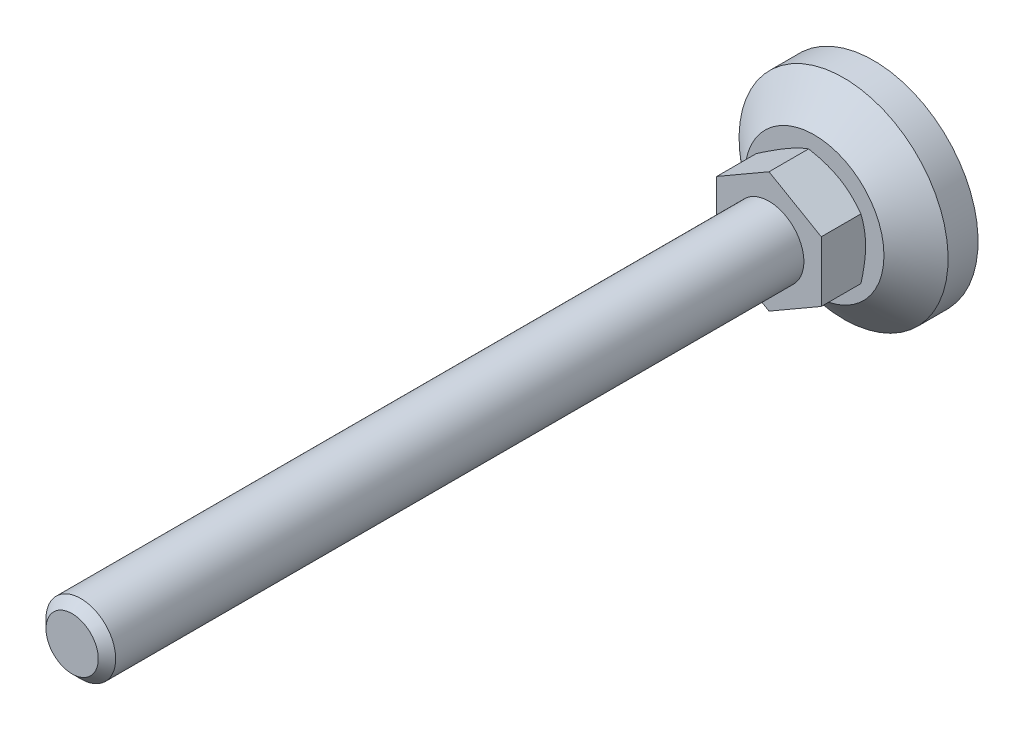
ISO-10303-21;
HEADER;
FILE_DESCRIPTION(('STEP AP214'),'2;1');
FILE_NAME('part.step','',(''),(''),'','','');
FILE_SCHEMA(('AUTOMOTIVE_DESIGN { 1 0 10303 214 1 1 1 1 }'));
ENDSEC;
DATA;
#1=APPLICATION_CONTEXT('core data for automotive mechanical design processes');
#2=APPLICATION_PROTOCOL_DEFINITION('international standard','automotive_design',2000,#1);
#3=PRODUCT_CONTEXT('',#1,'mechanical');
#4=PRODUCT('Part','Part','',(#3));
#5=PRODUCT_RELATED_PRODUCT_CATEGORY('part','',(#4));
#6=PRODUCT_DEFINITION_FORMATION('','',#4);
#7=PRODUCT_DEFINITION_CONTEXT('part definition',#1,'design');
#8=PRODUCT_DEFINITION('design','',#6,#7);
#9=PRODUCT_DEFINITION_SHAPE('','',#8);
#10=(LENGTH_UNIT() NAMED_UNIT(*) SI_UNIT(.MILLI.,.METRE.));
#11=(NAMED_UNIT(*) PLANE_ANGLE_UNIT() SI_UNIT($,.RADIAN.));
#12=(NAMED_UNIT(*) SI_UNIT($,.STERADIAN.) SOLID_ANGLE_UNIT());
#13=UNCERTAINTY_MEASURE_WITH_UNIT(LENGTH_MEASURE(1.E-05),#10,'distance_accuracy_value','');
#14=(GEOMETRIC_REPRESENTATION_CONTEXT(3) GLOBAL_UNCERTAINTY_ASSIGNED_CONTEXT((#13)) GLOBAL_UNIT_ASSIGNED_CONTEXT((#10,
#11,#12)) REPRESENTATION_CONTEXT('',''));
#15=CARTESIAN_POINT('',(0.,0.,0.));
#16=DIRECTION('',(0.,0.,1.));
#17=DIRECTION('',(1.,0.,0.));
#18=AXIS2_PLACEMENT_3D('',#15,#16,#17);
#19=CARTESIAN_POINT('',(0.,0.,30.));
#20=DIRECTION('',(0.,0.,1.));
#21=DIRECTION('',(0.5,-0.86602540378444,0.));
#22=AXIS2_PLACEMENT_3D('',#19,#20,#21);
#23=PLANE('',#22);
#24=DIRECTION('',(0.,1.,0.));
#25=VECTOR('',#24,1.);
#26=CARTESIAN_POINT('',(15.,-8.66025403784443,30.));
#27=LINE('',#26,#25);
#28=CARTESIAN_POINT('',(15.,-8.66025403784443,30.));
#29=VERTEX_POINT('',#28);
#30=CARTESIAN_POINT('',(15.,8.66025403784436,30.));
#31=VERTEX_POINT('',#30);
#32=EDGE_CURVE('E197',#29,#31,#27,.T.);
#33=ORIENTED_EDGE('',*,*,#32,.T.);
#34=DIRECTION('',(-0.866025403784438,0.5,0.));
#35=VECTOR('',#34,1.);
#36=CARTESIAN_POINT('',(15.,8.66025403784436,30.));
#37=LINE('',#36,#35);
#38=CARTESIAN_POINT('',(0.,17.3205080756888,30.));
#39=VERTEX_POINT('',#38);
#40=EDGE_CURVE('E320',#31,#39,#37,.T.);
#41=ORIENTED_EDGE('',*,*,#40,.T.);
#42=DIRECTION('',(-0.86602540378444,-0.5,0.));
#43=VECTOR('',#42,1.);
#44=CARTESIAN_POINT('',(0.,17.3205080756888,30.));
#45=LINE('',#44,#43);
#46=CARTESIAN_POINT('',(-15.,8.66025403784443,30.));
#47=VERTEX_POINT('',#46);
#48=EDGE_CURVE('E319',#39,#47,#45,.T.);
#49=ORIENTED_EDGE('',*,*,#48,.T.);
#50=DIRECTION('',(0.,-1.,0.));
#51=VECTOR('',#50,1.);
#52=CARTESIAN_POINT('',(-15.,8.66025403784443,30.));
#53=LINE('',#52,#51);
#54=CARTESIAN_POINT('',(-15.,-8.66025403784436,30.));
#55=VERTEX_POINT('',#54);
#56=EDGE_CURVE('E324',#47,#55,#53,.T.);
#57=ORIENTED_EDGE('',*,*,#56,.T.);
#58=DIRECTION('',(0.866025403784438,-0.5,0.));
#59=VECTOR('',#58,1.);
#60=CARTESIAN_POINT('',(-15.,-8.66025403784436,30.));
#61=LINE('',#60,#59);
#62=CARTESIAN_POINT('',(0.,-17.3205080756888,30.));
#63=VERTEX_POINT('',#62);
#64=EDGE_CURVE('E326',#55,#63,#61,.T.);
#65=ORIENTED_EDGE('',*,*,#64,.T.);
#66=DIRECTION('',(0.86602540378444,0.5,0.));
#67=VECTOR('',#66,1.);
#68=CARTESIAN_POINT('',(0.,-17.3205080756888,30.));
#69=LINE('',#68,#67);
#70=EDGE_CURVE('E37',#63,#29,#69,.T.);
#71=ORIENTED_EDGE('',*,*,#70,.T.);
#72=EDGE_LOOP('',(#33,#41,#49,#57,#65,#71));
#73=FACE_BOUND('',#72,.T.);
#74=CARTESIAN_POINT('',(0.,0.,30.));
#75=DIRECTION('',(0.,0.,1.));
#76=DIRECTION('',(0.5,-0.86602540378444,0.));
#77=AXIS2_PLACEMENT_3D('',#74,#75,#76);
#78=CIRCLE('',#77,10.);
#79=CARTESIAN_POINT('',(5.,-8.6602540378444,30.));
#80=VERTEX_POINT('',#79);
#81=EDGE_CURVE('E201',#80,#80,#78,.T.);
#82=ORIENTED_EDGE('',*,*,#81,.F.);
#83=EDGE_LOOP('',(#82));
#84=FACE_BOUND('',#83,.T.);
#85=ADVANCED_FACE('F14',(#73,#84),#23,.T.);
#86=CARTESIAN_POINT('',(-9.9946349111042,17.3112154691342,17.));
#87=DIRECTION('',(0.,0.,1.));
#88=DIRECTION('',(0.5,-0.86602540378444,0.));
#89=AXIS2_PLACEMENT_3D('',#86,#87,#88);
#90=PLANE('',#89);
#91=CARTESIAN_POINT('',(0.,0.,17.));
#92=DIRECTION('',(0.,0.,-1.));
#93=DIRECTION('',(-0.5,0.86602540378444,0.));
#94=AXIS2_PLACEMENT_3D('',#91,#92,#93);
#95=CIRCLE('',#94,19.9892698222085);
#96=CARTESIAN_POINT('',(-9.99463491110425,17.3112154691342,17.));
#97=VERTEX_POINT('',#96);
#98=EDGE_CURVE('E102',#97,#97,#95,.T.);
#99=ORIENTED_EDGE('',*,*,#98,.F.);
#100=EDGE_LOOP('',(#99));
#101=FACE_BOUND('',#100,.T.);
#102=CARTESIAN_POINT('',(0.,0.,17.));
#103=DIRECTION('',(0.,0.,-1.));
#104=DIRECTION('',(-0.5,0.86602540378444,0.));
#105=AXIS2_PLACEMENT_3D('',#102,#103,#104);
#106=CIRCLE('',#105,14.5);
#107=CARTESIAN_POINT('',(-7.25,12.5573683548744,17.));
#108=VERTEX_POINT('',#107);
#109=EDGE_CURVE('E84',#108,#108,#106,.T.);
#110=ORIENTED_EDGE('',*,*,#109,.T.);
#111=EDGE_LOOP('',(#110));
#112=FACE_BOUND('',#111,.T.);
#113=ADVANCED_FACE('F174',(#101,#112),#90,.T.);
#114=CARTESIAN_POINT('',(0.,0.,0.));
#115=DIRECTION('',(0.,0.,-1.));
#116=DIRECTION('',(-0.5,0.86602540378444,0.));
#117=AXIS2_PLACEMENT_3D('',#114,#115,#116);
#118=PLANE('',#117);
#119=CARTESIAN_POINT('',(0.,0.,0.));
#120=DIRECTION('',(0.,0.,-1.));
#121=DIRECTION('',(-0.5,0.86602540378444,0.));
#122=AXIS2_PLACEMENT_3D('',#119,#120,#121);
#123=CIRCLE('',#122,30.);
#124=CARTESIAN_POINT('',(-15.,25.9807621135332,0.));
#125=VERTEX_POINT('',#124);
#126=EDGE_CURVE('E73',#125,#125,#123,.T.);
#127=ORIENTED_EDGE('',*,*,#126,.T.);
#128=EDGE_LOOP('',(#127));
#129=FACE_BOUND('',#128,.T.);
#130=ADVANCED_FACE('F177',(#129),#118,.T.);
#131=CARTESIAN_POINT('',(0.,0.,-75.4972525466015));
#132=DIRECTION('',(0.,0.,-1.));
#133=DIRECTION('',(-0.5,0.86602540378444,0.));
#134=AXIS2_PLACEMENT_3D('',#131,#132,#133);
#135=CYLINDRICAL_SURFACE('',#134,30.);
#136=CARTESIAN_POINT('',(0.,0.,8.6));
#137=DIRECTION('',(0.,0.,-1.));
#138=DIRECTION('',(-0.5,0.86602540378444,0.));
#139=AXIS2_PLACEMENT_3D('',#136,#137,#138);
#140=CIRCLE('',#139,30.);
#141=CARTESIAN_POINT('',(-15.,25.9807621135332,8.6));
#142=VERTEX_POINT('',#141);
#143=EDGE_CURVE('E105',#142,#142,#140,.T.);
#144=ORIENTED_EDGE('',*,*,#143,.T.);
#145=EDGE_LOOP('',(#144));
#146=FACE_BOUND('',#145,.T.);
#147=ORIENTED_EDGE('',*,*,#126,.F.);
#148=EDGE_LOOP('',(#147));
#149=FACE_BOUND('',#148,.T.);
#150=ADVANCED_FACE('F181',(#146,#149),#135,.T.);
#151=CARTESIAN_POINT('',(0.,0.,8.6));
#152=DIRECTION('',(0.,0.,-1.));
#153=DIRECTION('',(-0.5,0.86602540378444,0.));
#154=AXIS2_PLACEMENT_3D('',#151,#152,#153);
#155=CONICAL_SURFACE('',#154,30.,0.872664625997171);
#156=ORIENTED_EDGE('',*,*,#98,.T.);
#157=EDGE_LOOP('',(#156));
#158=FACE_BOUND('',#157,.T.);
#159=ORIENTED_EDGE('',*,*,#143,.F.);
#160=EDGE_LOOP('',(#159));
#161=FACE_BOUND('',#160,.T.);
#162=ADVANCED_FACE('F121',(#158,#161),#155,.T.);
#163=CARTESIAN_POINT('',(0.,0.,22.6717337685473));
#164=DIRECTION('',(0.,0.,1.));
#165=DIRECTION('',(0.5,-0.86602540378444,0.));
#166=AXIS2_PLACEMENT_3D('',#163,#164,#165);
#167=CONICAL_SURFACE('',#166,24.3237310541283,1.0471975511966);
#168=ORIENTED_EDGE('',*,*,#109,.F.);
#169=EDGE_LOOP('',(#168));
#170=FACE_BOUND('',#169,.T.);
#171=CARTESIAN_POINT('',(-12.8456594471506,-24.7369530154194,24.7211504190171));
#172=CARTESIAN_POINT('',(-12.5611280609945,-24.5726787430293,24.5612751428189));
#173=CARTESIAN_POINT('',(-12.2762681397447,-24.4082147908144,24.4021798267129));
#174=CARTESIAN_POINT('',(-11.7058227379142,-24.0788679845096,24.0857253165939));
#175=CARTESIAN_POINT('',(-11.4202372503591,-23.913985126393,23.9283661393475));
#176=CARTESIAN_POINT('',(-10.5622163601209,-23.4186065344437,23.4591171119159));
#177=CARTESIAN_POINT('',(-9.98859766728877,-23.0874276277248,23.1501014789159));
#178=CARTESIAN_POINT('',(-8.83456075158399,-22.4211441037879,22.5399454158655));
#179=CARTESIAN_POINT('',(-8.25412262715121,-22.0860279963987,22.2388550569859));
#180=CARTESIAN_POINT('',(-7.08869976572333,-21.4131707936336,21.6486868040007));
#181=CARTESIAN_POINT('',(-6.50371523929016,-21.0754298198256,21.3596083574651));
#182=CARTESIAN_POINT('',(-5.30863673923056,-20.3854509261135,20.7872320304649));
#183=CARTESIAN_POINT('',(-4.69835665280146,-20.0331055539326,20.5044496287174));
#184=CARTESIAN_POINT('',(-3.47072651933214,-19.3243329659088,19.9597325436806));
#185=CARTESIAN_POINT('',(-2.85337569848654,-18.9679053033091,19.6978001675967));
#186=CARTESIAN_POINT('',(-1.61173392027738,-18.251043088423,19.2014950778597));
#187=CARTESIAN_POINT('',(-0.987459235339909,-17.8906179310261,18.9670685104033));
#188=CARTESIAN_POINT('',(0.270101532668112,-17.1645648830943,18.533130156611));
#189=CARTESIAN_POINT('',(0.903384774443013,-16.7989386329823,18.3336076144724));
#190=CARTESIAN_POINT('',(1.85843143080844,-16.2475421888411,18.0681549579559));
#191=CARTESIAN_POINT('',(2.17672728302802,-16.0637739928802,17.9854955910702));
#192=CARTESIAN_POINT('',(2.8155301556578,-15.6949609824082,17.8324159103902));
#193=CARTESIAN_POINT('',(3.13603713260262,-15.509916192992,17.761995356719));
#194=CARTESIAN_POINT('',(3.77905622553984,-15.1386689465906,17.6346216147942));
#195=CARTESIAN_POINT('',(4.1015683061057,-14.952466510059,17.5776681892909));
#196=CARTESIAN_POINT('',(4.7482706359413,-14.5790927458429,17.4783560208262));
#197=CARTESIAN_POINT('',(5.07246081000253,-14.39192146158,17.4359966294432));
#198=CARTESIAN_POINT('',(5.7177482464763,-14.0193645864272,17.3672579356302));
#199=CARTESIAN_POINT('',(6.03882895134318,-13.8339885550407,17.3406726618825));
#200=CARTESIAN_POINT('',(6.68167638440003,-13.4628404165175,17.3032157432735));
#201=CARTESIAN_POINT('',(7.0034431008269,-13.2770683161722,17.2923438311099));
#202=CARTESIAN_POINT('',(7.64708696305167,-12.9054603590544,17.2865732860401));
#203=CARTESIAN_POINT('',(7.96896410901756,-12.719624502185,17.291674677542));
#204=CARTESIAN_POINT('',(8.6122410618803,-12.3482283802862,17.31772364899));
#205=CARTESIAN_POINT('',(8.93364084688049,-12.1626681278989,17.3386719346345));
#206=CARTESIAN_POINT('',(9.70006843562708,-11.7201709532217,17.4070708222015));
#207=CARTESIAN_POINT('',(10.1446275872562,-11.4635046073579,17.4616548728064));
#208=CARTESIAN_POINT('',(11.0305797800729,-10.9519998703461,17.598223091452));
#209=CARTESIAN_POINT('',(11.4719724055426,-10.6971617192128,17.6802107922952));
#210=CARTESIAN_POINT('',(12.3511241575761,-10.1895832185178,17.8686701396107));
#211=CARTESIAN_POINT('',(12.7888803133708,-9.93684458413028,17.9751600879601));
#212=CARTESIAN_POINT('',(13.6600677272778,-9.43386429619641,18.2093621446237));
#213=CARTESIAN_POINT('',(14.093499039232,-9.18362261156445,18.3370739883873));
#214=CARTESIAN_POINT('',(14.9657613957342,-8.68002170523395,18.6136784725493));
#215=CARTESIAN_POINT('',(15.4044935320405,-8.42671958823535,18.7629840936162));
#216=CARTESIAN_POINT('',(16.2776387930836,-7.92260893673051,19.0774927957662));
#217=CARTESIAN_POINT('',(16.7120518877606,-7.67180041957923,19.2426959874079));
#218=CARTESIAN_POINT('',(17.5767675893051,-7.17255657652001,19.5863356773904));
#219=CARTESIAN_POINT('',(18.0070714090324,-6.92412055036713,19.7647681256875));
#220=CARTESIAN_POINT('',(18.8640855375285,-6.42932321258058,20.1327209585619));
#221=CARTESIAN_POINT('',(19.2907959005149,-6.18296186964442,20.3222411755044));
#222=CARTESIAN_POINT('',(20.3428317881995,-5.57556866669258,20.8026992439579));
#223=CARTESIAN_POINT('',(20.9662920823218,-5.21561369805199,21.0990762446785));
#224=CARTESIAN_POINT('',(22.2075096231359,-4.49899641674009,21.7073961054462));
#225=CARTESIAN_POINT('',(22.8252664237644,-4.14233436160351,22.0193401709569));
#226=CARTESIAN_POINT('',(24.0562171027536,-3.43164465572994,22.6554928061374));
#227=CARTESIAN_POINT('',(24.6694096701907,-3.07761776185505,22.9797047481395));
#228=CARTESIAN_POINT('',(25.8918722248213,-2.37182867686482,23.6377669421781));
#229=CARTESIAN_POINT('',(26.5011423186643,-2.02006642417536,23.9716169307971));
#230=CARTESIAN_POINT('',(27.717227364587,-1.31795939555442,24.6474851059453));
#231=CARTESIAN_POINT('',(28.3240381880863,-0.967617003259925,24.9895131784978));
#232=CARTESIAN_POINT('',(29.5349682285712,-0.268486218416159,25.6798644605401));
#233=CARTESIAN_POINT('',(30.1390874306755,0.0803021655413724,26.0281877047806));
#234=CARTESIAN_POINT('',(31.3449758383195,0.776522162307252,26.7299417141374));
#235=CARTESIAN_POINT('',(31.9467453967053,1.12395397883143,27.0833716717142));
#236=CARTESIAN_POINT('',(33.1483798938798,1.81771797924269,27.7945141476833));
#237=CARTESIAN_POINT('',(33.7482448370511,2.16405016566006,28.1522266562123));
#238=CARTESIAN_POINT('',(35.4362393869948,3.13861427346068,29.1651922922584));
#239=CARTESIAN_POINT('',(36.5225182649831,3.76577767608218,29.8245570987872));
#240=CARTESIAN_POINT('',(38.6911220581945,5.01782165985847,31.1520110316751));
#241=CARTESIAN_POINT('',(39.7734467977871,5.64270213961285,31.8201005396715));
#242=CARTESIAN_POINT('',(41.9319563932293,6.88891823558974,33.1609996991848));
#243=CARTESIAN_POINT('',(43.0081499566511,7.51025887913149,33.8337906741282));
#244=CARTESIAN_POINT('',(44.620597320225,8.441205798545,34.8467910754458));
#245=CARTESIAN_POINT('',(45.1577559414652,8.75133447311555,35.1850829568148));
#246=CARTESIAN_POINT('',(46.2315316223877,9.37127915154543,35.8628086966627));
#247=CARTESIAN_POINT('',(46.7681486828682,9.68109515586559,36.2022425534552));
#248=CARTESIAN_POINT('',(47.3045265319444,9.99077305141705,36.5421798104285));
#249=B_SPLINE_CURVE_WITH_KNOTS('',3,(#171,#172,#173,#174,#175,#176,#177,#178,#179,#180,#181,
#182,#183,#184,#185,#186,#187,#188,#189,#190,#191,#192,#193,#194,#195,#196,#197,#198,#199,#200,
#201,#202,#203,#204,#205,#206,#207,#208,#209,#210,#211,#212,#213,#214,#215,#216,#217,#218,#219,
#220,#221,#222,#223,#224,#225,#226,#227,#228,#229,#230,#231,#232,#233,#234,#235,#236,#237,#238,
#239,#240,#241,#242,#243,#244,#245,#246,#247,#248),.UNSPECIFIED.,.F.,.F.,(4,2,2,2,2,2,2,2,2,2,2,
2,2,2,2,2,2,2,2,2,2,2,2,2,2,2,2,2,2,2,2,2,2,2,2,2,2,2,4),(0.,1.09614509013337,2.19230075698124,
4.38492481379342,6.5891013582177,8.79317641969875,11.0708608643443,13.3487970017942,
15.622195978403,17.894893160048,19.0248728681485,20.1548304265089,21.2847680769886,
22.4146555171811,23.5294447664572,24.6442150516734,25.7589870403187,26.8738086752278,
28.4216372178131,29.9696653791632,31.5188536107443,33.0680225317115,34.6521549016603,
36.236298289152,37.8199586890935,39.4035951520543,41.7389293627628,44.0744446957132,
46.4106067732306,48.7467050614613,51.0857864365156,53.4248807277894,55.7636090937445,
58.1023320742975,62.3535003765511,66.6048552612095,70.8441948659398,72.9637328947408,
75.083267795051),.UNSPECIFIED.);
#250=CARTESIAN_POINT('',(0.,-17.3205080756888,18.6284210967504));
#251=VERTEX_POINT('',#250);
#252=CARTESIAN_POINT('',(15.,-8.66025403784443,18.6284210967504));
#253=VERTEX_POINT('',#252);
#254=EDGE_CURVE('E65',#251,#253,#249,.T.);
#255=ORIENTED_EDGE('',*,*,#254,.F.);
#256=CARTESIAN_POINT('',(-15.0002,-8.66013856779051,18.6284877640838));
#257=CARTESIAN_POINT('',(-14.6705058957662,-8.85048754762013,18.5185969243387));
#258=CARTESIAN_POINT('',(-14.3395258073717,-9.0415789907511,18.4136927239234));
#259=CARTESIAN_POINT('',(-13.674911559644,-9.42529420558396,18.2152437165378));
#260=CARTESIAN_POINT('',(-13.3412765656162,-9.61791845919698,18.1217026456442));
#261=CARTESIAN_POINT('',(-12.6707077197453,-10.0050715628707,17.9472372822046));
#262=CARTESIAN_POINT('',(-12.333767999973,-10.1996038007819,17.8663428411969));
#263=CARTESIAN_POINT('',(-11.6575472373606,-10.5900200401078,17.7189077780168));
#264=CARTESIAN_POINT('',(-11.3182663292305,-10.7859039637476,17.6523663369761));
#265=CARTESIAN_POINT('',(-10.6460568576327,-11.1740042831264,17.5364675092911));
#266=CARTESIAN_POINT('',(-10.3131781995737,-11.3661918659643,17.4867265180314));
#267=CARTESIAN_POINT('',(-9.64589556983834,-11.7514476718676,17.4033218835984));
#268=CARTESIAN_POINT('',(-9.31149156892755,-11.9445159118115,17.3696585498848));
#269=CARTESIAN_POINT('',(-8.64212181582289,-12.3309767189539,17.3192592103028));
#270=CARTESIAN_POINT('',(-8.30715720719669,-12.5243686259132,17.3025030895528));
#271=CARTESIAN_POINT('',(-7.63691878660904,-12.9113309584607,17.2862785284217));
#272=CARTESIAN_POINT('',(-7.30164498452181,-13.104901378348,17.2868095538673));
#273=CARTESIAN_POINT('',(-6.67485311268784,-13.4667798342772,17.303951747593));
#274=CARTESIAN_POINT('',(-6.38329037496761,-13.6351136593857,17.3184719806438));
#275=CARTESIAN_POINT('',(-5.80083556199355,-13.971394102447,17.3603122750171));
#276=CARTESIAN_POINT('',(-5.50994353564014,-14.1393406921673,17.3876332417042));
#277=CARTESIAN_POINT('',(-4.9289881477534,-14.4747554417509,17.4545986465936));
#278=CARTESIAN_POINT('',(-4.63892567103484,-14.6422230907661,17.4942532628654));
#279=CARTESIAN_POINT('',(-4.06016058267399,-14.9763732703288,17.5851902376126));
#280=CARTESIAN_POINT('',(-3.77145806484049,-15.1430557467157,17.636473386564));
#281=CARTESIAN_POINT('',(-2.89508556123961,-15.6490296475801,17.8090619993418));
#282=CARTESIAN_POINT('',(-2.30995340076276,-15.9868558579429,17.9475763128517));
#283=CARTESIAN_POINT('',(-1.14841408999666,-16.657470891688,18.26194710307));
#284=CARTESIAN_POINT('',(-0.571992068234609,-16.9902683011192,18.4377297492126));
#285=CARTESIAN_POINT('',(0.000199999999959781,-17.3206235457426,18.6284877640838));
#286=B_SPLINE_CURVE_WITH_KNOTS('',3,(#256,#257,#258,#259,#260,#261,#262,#263,#264,#265,#266,
#267,#268,#269,#270,#271,#272,#273,#274,#275,#276,#277,#278,#279,#280,#281,#282,#283,#284,#285),
.UNSPECIFIED.,.F.,.F.,(4,2,2,2,2,2,2,2,2,2,2,2,2,2,4),(0.,1.18875411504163,2.37789802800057,
3.56980778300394,4.76164951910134,5.92407379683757,7.08652044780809,8.24758247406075,
9.40860862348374,10.4193068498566,11.4300765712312,12.4416826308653,13.4533574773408,
15.5211962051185,17.5849760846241),.UNSPECIFIED.);
#287=CARTESIAN_POINT('',(-15.,-8.66025403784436,18.6284210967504));
#288=VERTEX_POINT('',#287);
#289=EDGE_CURVE('E68',#288,#251,#286,.T.);
#290=ORIENTED_EDGE('',*,*,#289,.F.);
#291=CARTESIAN_POINT('',(-15.,8.66048497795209,18.6284877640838));
#292=CARTESIAN_POINT('',(-15.,8.27978701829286,18.5185969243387));
#293=CARTESIAN_POINT('',(-15.,7.89760413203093,18.4136927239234));
#294=CARTESIAN_POINT('',(-15.,7.13017370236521,18.2152437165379));
#295=CARTESIAN_POINT('',(-15.,6.74492519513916,18.1217026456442));
#296=CARTESIAN_POINT('',(-15.,5.97061898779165,17.9472372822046));
#297=CARTESIAN_POINT('',(-15.,5.58155451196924,17.8663428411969));
#298=CARTESIAN_POINT('',(-15.,4.80072203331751,17.7189077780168));
#299=CARTESIAN_POINT('',(-15.,4.40895418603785,17.6523663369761));
#300=CARTESIAN_POINT('',(-15.,3.63275354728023,17.5364675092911));
#301=CARTESIAN_POINT('',(-15.,3.24837838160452,17.4867265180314));
#302=CARTESIAN_POINT('',(-15.,2.47786676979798,17.4033218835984));
#303=CARTESIAN_POINT('',(-15.,2.0917302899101,17.3696585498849));
#304=CARTESIAN_POINT('',(-15.,1.31880867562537,17.3192592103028));
#305=CARTESIAN_POINT('',(-15.,0.932024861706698,17.3025030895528));
#306=CARTESIAN_POINT('',(-15.,0.158100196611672,17.2862785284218));
#307=CARTESIAN_POINT('',(-15.,-0.229040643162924,17.2868095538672));
#308=CARTESIAN_POINT('',(-15.,-0.952797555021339,17.303951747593));
#309=CARTESIAN_POINT('',(-15.,-1.28946520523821,17.3184719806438));
#310=CARTESIAN_POINT('',(-15.,-1.96202609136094,17.3603122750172));
#311=CARTESIAN_POINT('',(-15.,-2.29791927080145,17.3876332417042));
#312=CARTESIAN_POINT('',(-15.,-2.96874876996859,17.4545986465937));
#313=CARTESIAN_POINT('',(-15.,-3.30368406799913,17.4942532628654));
#314=CARTESIAN_POINT('',(-15.,-3.97198442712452,17.5851902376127));
#315=CARTESIAN_POINT('',(-15.,-4.3053493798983,17.636473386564));
#316=CARTESIAN_POINT('',(-15.,-5.317297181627,17.8090619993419));
#317=CARTESIAN_POINT('',(-15.,-5.99294960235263,17.9475763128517));
#318=CARTESIAN_POINT('',(-15.,-7.33417966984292,18.26194710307));
#319=CARTESIAN_POINT('',(-15.,-7.99977448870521,18.4377297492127));
#320=CARTESIAN_POINT('',(-15.,-8.66048497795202,18.6284877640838));
#321=B_SPLINE_CURVE_WITH_KNOTS('',3,(#291,#292,#293,#294,#295,#296,#297,#298,#299,#300,#301,
#302,#303,#304,#305,#306,#307,#308,#309,#310,#311,#312,#313,#314,#315,#316,#317,#318,#319,#320),
.UNSPECIFIED.,.F.,.F.,(4,2,2,2,2,2,2,2,2,2,2,2,2,2,4),(0.,1.18875411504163,2.37789802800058,
3.56980778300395,4.76164951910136,5.92407379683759,7.08652044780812,8.24758247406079,
9.40860862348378,10.4193068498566,11.4300765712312,12.4416826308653,13.4533574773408,
15.5211962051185,17.5849760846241),.UNSPECIFIED.);
#322=CARTESIAN_POINT('',(-15.,8.66025403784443,18.6284210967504));
#323=VERTEX_POINT('',#322);
#324=EDGE_CURVE('E83',#323,#288,#321,.T.);
#325=ORIENTED_EDGE('',*,*,#324,.F.);
#326=CARTESIAN_POINT('',(-27.8456594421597,1.24380910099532,24.7211504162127));
#327=CARTESIAN_POINT('',(-27.5611280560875,1.40808337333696,24.561275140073));
#328=CARTESIAN_POINT('',(-27.2762681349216,1.5725473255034,24.4021798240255));
#329=CARTESIAN_POINT('',(-26.7058227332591,1.90189413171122,24.0857253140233));
#330=CARTESIAN_POINT('',(-26.4202372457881,2.06677698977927,23.9283661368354));
#331=CARTESIAN_POINT('',(-25.5622163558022,2.56215558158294,23.4591171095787));
#332=CARTESIAN_POINT('',(-24.9885976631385,2.89333448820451,23.150101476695));
#333=CARTESIAN_POINT('',(-23.8345607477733,3.55961801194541,22.5399454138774));
#334=CARTESIAN_POINT('',(-23.2541226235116,3.89473411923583,22.2388550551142));
#335=CARTESIAN_POINT('',(-22.088699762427,4.56759132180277,21.64868680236));
#336=CARTESIAN_POINT('',(-21.503715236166,4.9053322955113,21.3596083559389));
#337=CARTESIAN_POINT('',(-20.3086367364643,5.59531118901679,20.787232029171));
#338=CARTESIAN_POINT('',(-19.698356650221,5.94765656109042,20.5044496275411));
#339=CARTESIAN_POINT('',(-18.4707265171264,6.65642914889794,19.9597325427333));
#340=CARTESIAN_POINT('',(-17.8533756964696,7.01285681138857,19.6978001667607));
#341=CARTESIAN_POINT('',(-16.6117339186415,7.72971902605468,19.2014950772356));
#342=CARTESIAN_POINT('',(-15.9874592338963,8.09014418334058,18.96706850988));
#343=CARTESIAN_POINT('',(-14.7298984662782,8.81619723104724,18.5331301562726));
#344=CARTESIAN_POINT('',(-14.0966152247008,9.1818234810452,18.3336076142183));
#345=CARTESIAN_POINT('',(-13.1415685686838,9.73321992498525,18.0681549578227));
#346=CARTESIAN_POINT('',(-12.8232727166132,9.91698812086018,17.9854955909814));
#347=CARTESIAN_POINT('',(-12.1844698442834,10.2858011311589,17.8324159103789));
#348=CARTESIAN_POINT('',(-11.8639628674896,10.4708459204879,17.7619953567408));
#349=CARTESIAN_POINT('',(-11.2209437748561,10.8420931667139,17.6346216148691));
#350=CARTESIAN_POINT('',(-10.898431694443,11.0282956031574,17.5776681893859));
#351=CARTESIAN_POINT('',(-10.2517293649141,11.4016693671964,17.4783560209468));
#352=CARTESIAN_POINT('',(-9.92753919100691,11.5888406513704,17.4359966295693));
#353=CARTESIAN_POINT('',(-9.28225175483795,11.9613975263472,17.3672579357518));
#354=CARTESIAN_POINT('',(-8.96117105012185,12.1467735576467,17.3406726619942));
#355=CARTESIAN_POINT('',(-8.31832361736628,12.5179216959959,17.30321574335));
#356=CARTESIAN_POINT('',(-7.9965569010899,12.7036937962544,17.2923438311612));
#357=CARTESIAN_POINT('',(-7.352913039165,13.075301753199,17.2865732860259));
#358=CARTESIAN_POINT('',(-7.03103589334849,13.2611376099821,17.2916746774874));
#359=CARTESIAN_POINT('',(-6.38775894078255,13.6325337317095,17.3177236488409));
#360=CARTESIAN_POINT('',(-6.06635915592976,13.8180939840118,17.3386719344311));
#361=CARTESIAN_POINT('',(-5.29993156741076,14.2605911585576,17.4070708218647));
#362=CARTESIAN_POINT('',(-4.85537241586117,14.5172575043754,17.4616548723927));
#363=CARTESIAN_POINT('',(-3.96942022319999,15.0287622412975,17.5982230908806));
#364=CARTESIAN_POINT('',(-3.52802759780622,15.2836003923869,17.6802107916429));
#365=CARTESIAN_POINT('',(-2.64887584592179,15.7911788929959,17.8686701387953));
#366=CARTESIAN_POINT('',(-2.21111969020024,16.0439175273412,17.9751600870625));
#367=CARTESIAN_POINT('',(-1.33993227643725,16.5468978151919,18.2093621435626));
#368=CARTESIAN_POINT('',(-0.906500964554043,16.7971394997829,18.3370739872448));
#369=CARTESIAN_POINT('',(-0.0342386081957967,17.3007404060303,18.6136784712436));
#370=CARTESIAN_POINT('',(0.404493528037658,17.5540425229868,18.7629840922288));
#371=CARTESIAN_POINT('',(1.27763878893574,18.0581531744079,19.0774927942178));
#372=CARTESIAN_POINT('',(1.71205188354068,18.3089616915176,19.2426959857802));
#373=CARTESIAN_POINT('',(2.57676758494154,18.8082055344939,19.586335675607));
#374=CARTESIAN_POINT('',(3.00707140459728,19.0566415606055,19.7647681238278));
#375=CARTESIAN_POINT('',(3.86408553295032,19.5514388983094,20.1327209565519));
#376=CARTESIAN_POINT('',(4.29079589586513,19.7978002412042,20.3222411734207));
#377=CARTESIAN_POINT('',(5.34283178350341,20.4051934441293,20.8026992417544));
#378=CARTESIAN_POINT('',(5.9662920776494,20.7651484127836,21.0990762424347));
#379=CARTESIAN_POINT('',(7.20750961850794,21.4817656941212,21.707396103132));
#380=CARTESIAN_POINT('',(7.82526641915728,21.8384277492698,22.0193401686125));
#381=CARTESIAN_POINT('',(9.05621709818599,22.5491174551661,22.6554928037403));
#382=CARTESIAN_POINT('',(9.66940966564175,22.9031443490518,22.97970474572));
#383=CARTESIAN_POINT('',(10.8918722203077,23.6089334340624,23.6377669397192));
#384=CARTESIAN_POINT('',(11.5011423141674,23.9606956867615,23.9716169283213));
#385=CARTESIAN_POINT('',(12.7172273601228,24.6628027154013,24.6474851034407));
#386=CARTESIAN_POINT('',(13.3240381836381,25.0131451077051,24.9895131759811));
#387=CARTESIAN_POINT('',(14.5349682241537,25.7122758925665,25.6798644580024));
#388=CARTESIAN_POINT('',(15.1390874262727,26.0610642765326,26.0281877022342));
#389=CARTESIAN_POINT('',(16.3449758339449,26.7572842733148,26.7299417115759));
#390=CARTESIAN_POINT('',(16.9467453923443,27.1047160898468,27.0833716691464));
#391=CARTESIAN_POINT('',(18.1483798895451,27.7984800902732,27.7945141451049));
#392=CARTESIAN_POINT('',(18.7482448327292,28.144812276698,28.1522266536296));
#393=CARTESIAN_POINT('',(20.4362393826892,29.119376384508,29.1651922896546));
#394=CARTESIAN_POINT('',(21.5225182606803,29.7465397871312,29.8245570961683));
#395=CARTESIAN_POINT('',(23.6911220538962,30.99858377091,31.1520110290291));
#396=CARTESIAN_POINT('',(24.7734467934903,31.6234642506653,31.8201005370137));
#397=CARTESIAN_POINT('',(26.9319563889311,32.8696803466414,33.1609996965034));
#398=CARTESIAN_POINT('',(28.0081499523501,33.4910209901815,33.833790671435));
#399=CARTESIAN_POINT('',(29.6205973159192,34.4219679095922,34.8467910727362));
#400=CARTESIAN_POINT('',(30.1577559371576,34.7320965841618,35.1850829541));
#401=CARTESIAN_POINT('',(31.2315316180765,35.3520412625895,35.8628086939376));
#402=CARTESIAN_POINT('',(31.7681486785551,35.6618572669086,36.2022425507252));
#403=CARTESIAN_POINT('',(32.3045265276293,35.9715351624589,36.5421798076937));
#404=B_SPLINE_CURVE_WITH_KNOTS('',3,(#326,#327,#328,#329,#330,#331,#332,#333,#334,#335,#336,
#337,#338,#339,#340,#341,#342,#343,#344,#345,#346,#347,#348,#349,#350,#351,#352,#353,#354,#355,
#356,#357,#358,#359,#360,#361,#362,#363,#364,#365,#366,#367,#368,#369,#370,#371,#372,#373,#374,
#375,#376,#377,#378,#379,#380,#381,#382,#383,#384,#385,#386,#387,#388,#389,#390,#391,#392,#393,
#394,#395,#396,#397,#398,#399,#400,#401,#402,#403),.UNSPECIFIED.,.F.,.F.,(4,2,2,2,2,2,2,2,2,2,2,
2,2,2,2,2,2,2,2,2,2,2,2,2,2,2,2,2,2,2,2,2,2,2,2,2,2,2,4),(0.,1.09614508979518,2.19230075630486,
4.38492481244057,6.5891013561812,8.79317641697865,11.0708608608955,13.3487969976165,
15.6221959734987,17.8948931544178,19.024872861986,20.1548304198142,21.2847680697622,
22.4146555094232,23.5294447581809,24.6442150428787,25.7589870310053,26.8738086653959,
28.421637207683,29.9696653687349,31.5188536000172,33.0680225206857,34.6521548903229,
36.2362982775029,37.8199586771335,39.4035951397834,41.7389293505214,44.0744446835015,
46.4106067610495,48.7467050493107,51.0857864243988,53.4248807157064,55.7636090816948,
58.1023320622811,62.3535003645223,66.6048552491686,70.8441948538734,72.9637328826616,
75.0832677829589),.UNSPECIFIED.);
#405=CARTESIAN_POINT('',(0.,17.3205080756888,18.6284210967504));
#406=VERTEX_POINT('',#405);
#407=EDGE_CURVE('E143',#406,#323,#404,.F.);
#408=ORIENTED_EDGE('',*,*,#407,.F.);
#409=CARTESIAN_POINT('',(15.0002,8.66013856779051,18.6284877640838));
#410=CARTESIAN_POINT('',(14.6705058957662,8.85048754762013,18.5185969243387));
#411=CARTESIAN_POINT('',(14.3395258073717,9.0415789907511,18.4136927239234));
#412=CARTESIAN_POINT('',(13.674911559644,9.42529420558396,18.2152437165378));
#413=CARTESIAN_POINT('',(13.3412765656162,9.61791845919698,18.1217026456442));
#414=CARTESIAN_POINT('',(12.6707077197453,10.0050715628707,17.9472372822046));
#415=CARTESIAN_POINT('',(12.333767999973,10.1996038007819,17.8663428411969));
#416=CARTESIAN_POINT('',(11.6575472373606,10.5900200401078,17.7189077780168));
#417=CARTESIAN_POINT('',(11.3182663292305,10.7859039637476,17.6523663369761));
#418=CARTESIAN_POINT('',(10.6460568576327,11.1740042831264,17.5364675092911));
#419=CARTESIAN_POINT('',(10.3131781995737,11.3661918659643,17.4867265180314));
#420=CARTESIAN_POINT('',(9.64589556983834,11.7514476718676,17.4033218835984));
#421=CARTESIAN_POINT('',(9.31149156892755,11.9445159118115,17.3696585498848));
#422=CARTESIAN_POINT('',(8.64212181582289,12.3309767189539,17.3192592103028));
#423=CARTESIAN_POINT('',(8.30715720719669,12.5243686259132,17.3025030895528));
#424=CARTESIAN_POINT('',(7.63691878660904,12.9113309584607,17.2862785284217));
#425=CARTESIAN_POINT('',(7.30164498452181,13.104901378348,17.2868095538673));
#426=CARTESIAN_POINT('',(6.67485311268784,13.4667798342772,17.303951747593));
#427=CARTESIAN_POINT('',(6.38329037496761,13.6351136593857,17.3184719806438));
#428=CARTESIAN_POINT('',(5.80083556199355,13.971394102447,17.3603122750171));
#429=CARTESIAN_POINT('',(5.50994353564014,14.1393406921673,17.3876332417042));
#430=CARTESIAN_POINT('',(4.9289881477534,14.4747554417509,17.4545986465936));
#431=CARTESIAN_POINT('',(4.63892567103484,14.6422230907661,17.4942532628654));
#432=CARTESIAN_POINT('',(4.06016058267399,14.9763732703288,17.5851902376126));
#433=CARTESIAN_POINT('',(3.77145806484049,15.1430557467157,17.636473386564));
#434=CARTESIAN_POINT('',(2.89508556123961,15.6490296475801,17.8090619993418));
#435=CARTESIAN_POINT('',(2.30995340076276,15.9868558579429,17.9475763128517));
#436=CARTESIAN_POINT('',(1.14841408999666,16.657470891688,18.26194710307));
#437=CARTESIAN_POINT('',(0.571992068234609,16.9902683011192,18.4377297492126));
#438=CARTESIAN_POINT('',(-0.000199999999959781,17.3206235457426,18.6284877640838));
#439=B_SPLINE_CURVE_WITH_KNOTS('',3,(#409,#410,#411,#412,#413,#414,#415,#416,#417,#418,#419,
#420,#421,#422,#423,#424,#425,#426,#427,#428,#429,#430,#431,#432,#433,#434,#435,#436,#437,#438),
.UNSPECIFIED.,.F.,.F.,(4,2,2,2,2,2,2,2,2,2,2,2,2,2,4),(0.,1.18875411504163,2.37789802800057,
3.56980778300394,4.76164951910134,5.92407379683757,7.08652044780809,8.24758247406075,
9.40860862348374,10.4193068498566,11.4300765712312,12.4416826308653,13.4533574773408,
15.5211962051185,17.5849760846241),.UNSPECIFIED.);
#440=CARTESIAN_POINT('',(15.,8.66025403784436,18.6284210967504));
#441=VERTEX_POINT('',#440);
#442=EDGE_CURVE('E150',#441,#406,#439,.T.);
#443=ORIENTED_EDGE('',*,*,#442,.F.);
#444=CARTESIAN_POINT('',(15.,-8.66048497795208,18.6284877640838));
#445=CARTESIAN_POINT('',(15.,-8.27978701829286,18.5185969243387));
#446=CARTESIAN_POINT('',(15.,-7.89760413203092,18.4136927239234));
#447=CARTESIAN_POINT('',(15.,-7.1301737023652,18.2152437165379));
#448=CARTESIAN_POINT('',(15.,-6.74492519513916,18.1217026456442));
#449=CARTESIAN_POINT('',(15.,-5.97061898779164,17.9472372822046));
#450=CARTESIAN_POINT('',(15.,-5.58155451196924,17.8663428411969));
#451=CARTESIAN_POINT('',(15.,-4.8007220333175,17.7189077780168));
#452=CARTESIAN_POINT('',(15.,-4.40895418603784,17.6523663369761));
#453=CARTESIAN_POINT('',(15.,-3.63275354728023,17.5364675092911));
#454=CARTESIAN_POINT('',(15.,-3.24837838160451,17.4867265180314));
#455=CARTESIAN_POINT('',(15.,-2.47786676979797,17.4033218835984));
#456=CARTESIAN_POINT('',(15.,-2.0917302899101,17.3696585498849));
#457=CARTESIAN_POINT('',(15.,-1.31880867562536,17.3192592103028));
#458=CARTESIAN_POINT('',(15.,-0.932024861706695,17.3025030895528));
#459=CARTESIAN_POINT('',(15.,-0.158100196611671,17.2862785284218));
#460=CARTESIAN_POINT('',(15.,0.229040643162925,17.2868095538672));
#461=CARTESIAN_POINT('',(15.,0.952797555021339,17.303951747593));
#462=CARTESIAN_POINT('',(15.,1.28946520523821,17.3184719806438));
#463=CARTESIAN_POINT('',(15.,1.96202609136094,17.3603122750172));
#464=CARTESIAN_POINT('',(15.,2.29791927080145,17.3876332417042));
#465=CARTESIAN_POINT('',(15.,2.96874876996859,17.4545986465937));
#466=CARTESIAN_POINT('',(15.,3.30368406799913,17.4942532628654));
#467=CARTESIAN_POINT('',(15.,3.97198442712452,17.5851902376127));
#468=CARTESIAN_POINT('',(15.,4.3053493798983,17.636473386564));
#469=CARTESIAN_POINT('',(15.,5.317297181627,17.8090619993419));
#470=CARTESIAN_POINT('',(15.,5.99294960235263,17.9475763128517));
#471=CARTESIAN_POINT('',(15.,7.33417966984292,18.26194710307));
#472=CARTESIAN_POINT('',(15.,7.99977448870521,18.4377297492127));
#473=CARTESIAN_POINT('',(15.,8.66048497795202,18.6284877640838));
#474=B_SPLINE_CURVE_WITH_KNOTS('',3,(#444,#445,#446,#447,#448,#449,#450,#451,#452,#453,#454,
#455,#456,#457,#458,#459,#460,#461,#462,#463,#464,#465,#466,#467,#468,#469,#470,#471,#472,#473),
.UNSPECIFIED.,.F.,.F.,(4,2,2,2,2,2,2,2,2,2,2,2,2,2,4),(0.,1.18875411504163,2.37789802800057,
3.56980778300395,4.76164951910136,5.92407379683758,7.08652044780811,8.24758247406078,
9.40860862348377,10.4193068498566,11.4300765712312,12.4416826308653,13.4533574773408,
15.5211962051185,17.5849760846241),.UNSPECIFIED.);
#475=EDGE_CURVE('E29',#253,#441,#474,.T.);
#476=ORIENTED_EDGE('',*,*,#475,.F.);
#477=EDGE_LOOP('',(#255,#290,#325,#408,#443,#476));
#478=FACE_BOUND('',#477,.T.);
#479=ADVANCED_FACE('F67',(#170,#478),#167,.T.);
#480=CARTESIAN_POINT('',(0.,-17.3205080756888,30.));
#481=DIRECTION('',(-0.5,0.86602540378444,0.));
#482=DIRECTION('',(-0.86602540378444,-0.5,0.));
#483=AXIS2_PLACEMENT_3D('',#480,#481,#482);
#484=PLANE('',#483);
#485=DIRECTION('',(0.,0.,-1.));
#486=VECTOR('',#485,1.);
#487=CARTESIAN_POINT('',(0.,-17.3205080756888,30.));
#488=LINE('',#487,#486);
#489=EDGE_CURVE('E80',#63,#251,#488,.T.);
#490=ORIENTED_EDGE('',*,*,#489,.T.);
#491=ORIENTED_EDGE('',*,*,#254,.T.);
#492=DIRECTION('',(0.,0.,-1.));
#493=VECTOR('',#492,1.);
#494=CARTESIAN_POINT('',(15.,-8.66025403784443,30.));
#495=LINE('',#494,#493);
#496=EDGE_CURVE('E87',#29,#253,#495,.T.);
#497=ORIENTED_EDGE('',*,*,#496,.F.);
#498=ORIENTED_EDGE('',*,*,#70,.F.);
#499=EDGE_LOOP('',(#490,#491,#497,#498));
#500=FACE_BOUND('',#499,.T.);
#501=ADVANCED_FACE('F86',(#500),#484,.F.);
#502=CARTESIAN_POINT('',(-15.,-8.66025403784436,30.));
#503=DIRECTION('',(0.5,0.866025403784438,0.));
#504=DIRECTION('',(-0.866025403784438,0.5,0.));
#505=AXIS2_PLACEMENT_3D('',#502,#503,#504);
#506=PLANE('',#505);
#507=DIRECTION('',(0.,0.,-1.));
#508=VECTOR('',#507,1.);
#509=CARTESIAN_POINT('',(-15.,-8.66025403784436,30.));
#510=LINE('',#509,#508);
#511=EDGE_CURVE('E82',#55,#288,#510,.T.);
#512=ORIENTED_EDGE('',*,*,#511,.T.);
#513=ORIENTED_EDGE('',*,*,#289,.T.);
#514=ORIENTED_EDGE('',*,*,#489,.F.);
#515=ORIENTED_EDGE('',*,*,#64,.F.);
#516=EDGE_LOOP('',(#512,#513,#514,#515));
#517=FACE_BOUND('',#516,.T.);
#518=ADVANCED_FACE('F78',(#517),#506,.F.);
#519=CARTESIAN_POINT('',(-15.,8.66025403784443,30.));
#520=DIRECTION('',(1.,0.,0.));
#521=DIRECTION('',(0.,1.,0.));
#522=AXIS2_PLACEMENT_3D('',#519,#520,#521);
#523=PLANE('',#522);
#524=DIRECTION('',(0.,0.,-1.));
#525=VECTOR('',#524,1.);
#526=CARTESIAN_POINT('',(-15.,8.66025403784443,30.));
#527=LINE('',#526,#525);
#528=EDGE_CURVE('E89',#47,#323,#527,.T.);
#529=ORIENTED_EDGE('',*,*,#528,.T.);
#530=ORIENTED_EDGE('',*,*,#324,.T.);
#531=ORIENTED_EDGE('',*,*,#511,.F.);
#532=ORIENTED_EDGE('',*,*,#56,.F.);
#533=EDGE_LOOP('',(#529,#530,#531,#532));
#534=FACE_BOUND('',#533,.T.);
#535=ADVANCED_FACE('F297',(#534),#523,.F.);
#536=CARTESIAN_POINT('',(0.,17.3205080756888,30.));
#537=DIRECTION('',(0.5,-0.86602540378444,0.));
#538=DIRECTION('',(0.86602540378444,0.5,0.));
#539=AXIS2_PLACEMENT_3D('',#536,#537,#538);
#540=PLANE('',#539);
#541=DIRECTION('',(0.,0.,-1.));
#542=VECTOR('',#541,1.);
#543=CARTESIAN_POINT('',(0.,17.3205080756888,30.));
#544=LINE('',#543,#542);
#545=EDGE_CURVE('E96',#39,#406,#544,.T.);
#546=ORIENTED_EDGE('',*,*,#545,.T.);
#547=ORIENTED_EDGE('',*,*,#407,.T.);
#548=ORIENTED_EDGE('',*,*,#528,.F.);
#549=ORIENTED_EDGE('',*,*,#48,.F.);
#550=EDGE_LOOP('',(#546,#547,#548,#549));
#551=FACE_BOUND('',#550,.T.);
#552=ADVANCED_FACE('F167',(#551),#540,.F.);
#553=CARTESIAN_POINT('',(15.,8.66025403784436,30.));
#554=DIRECTION('',(-0.5,-0.866025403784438,0.));
#555=DIRECTION('',(0.866025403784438,-0.5,0.));
#556=AXIS2_PLACEMENT_3D('',#553,#554,#555);
#557=PLANE('',#556);
#558=DIRECTION('',(0.,0.,-1.));
#559=VECTOR('',#558,1.);
#560=CARTESIAN_POINT('',(15.,8.66025403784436,30.));
#561=LINE('',#560,#559);
#562=EDGE_CURVE('E99',#31,#441,#561,.T.);
#563=ORIENTED_EDGE('',*,*,#562,.T.);
#564=ORIENTED_EDGE('',*,*,#442,.T.);
#565=ORIENTED_EDGE('',*,*,#545,.F.);
#566=ORIENTED_EDGE('',*,*,#40,.F.);
#567=EDGE_LOOP('',(#563,#564,#565,#566));
#568=FACE_BOUND('',#567,.T.);
#569=ADVANCED_FACE('F163',(#568),#557,.F.);
#570=CARTESIAN_POINT('',(15.,-8.66025403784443,30.));
#571=DIRECTION('',(-1.,0.,0.));
#572=DIRECTION('',(0.,-1.,0.));
#573=AXIS2_PLACEMENT_3D('',#570,#571,#572);
#574=PLANE('',#573);
#575=ORIENTED_EDGE('',*,*,#496,.T.);
#576=ORIENTED_EDGE('',*,*,#475,.T.);
#577=ORIENTED_EDGE('',*,*,#562,.F.);
#578=ORIENTED_EDGE('',*,*,#32,.F.);
#579=EDGE_LOOP('',(#575,#576,#577,#578));
#580=FACE_BOUND('',#579,.T.);
#581=ADVANCED_FACE('F166',(#580),#574,.F.);
#582=CARTESIAN_POINT('',(0.,0.,230.));
#583=DIRECTION('',(0.,0.,-1.));
#584=DIRECTION('',(-0.5,0.86602540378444,0.));
#585=AXIS2_PLACEMENT_3D('',#582,#583,#584);
#586=CYLINDRICAL_SURFACE('',#585,10.);
#587=CARTESIAN_POINT('',(0.,0.,227.5));
#588=DIRECTION('',(0.,0.,1.));
#589=DIRECTION('',(0.5,-0.86602540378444,0.));
#590=AXIS2_PLACEMENT_3D('',#587,#588,#589);
#591=CIRCLE('',#590,10.);
#592=CARTESIAN_POINT('',(5.,-8.6602540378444,227.5));
#593=VERTEX_POINT('',#592);
#594=EDGE_CURVE('E9',#593,#593,#591,.F.);
#595=ORIENTED_EDGE('',*,*,#594,.T.);
#596=EDGE_LOOP('',(#595));
#597=FACE_BOUND('',#596,.T.);
#598=ORIENTED_EDGE('',*,*,#81,.T.);
#599=EDGE_LOOP('',(#598));
#600=FACE_BOUND('',#599,.T.);
#601=ADVANCED_FACE('F123',(#597,#600),#586,.T.);
#602=CARTESIAN_POINT('',(0.,0.,230.));
#603=DIRECTION('',(0.,0.,1.));
#604=DIRECTION('',(0.5,-0.86602540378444,0.));
#605=AXIS2_PLACEMENT_3D('',#602,#603,#604);
#606=PLANE('',#605);
#607=CARTESIAN_POINT('',(0.,0.,230.));
#608=DIRECTION('',(0.,0.,1.));
#609=DIRECTION('',(0.5,-0.86602540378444,0.));
#610=AXIS2_PLACEMENT_3D('',#607,#608,#609);
#611=CIRCLE('',#610,7.50000000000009);
#612=CARTESIAN_POINT('',(3.75000000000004,-6.49519052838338,230.));
#613=VERTEX_POINT('',#612);
#614=EDGE_CURVE('E22',#613,#613,#611,.T.);
#615=ORIENTED_EDGE('',*,*,#614,.T.);
#616=EDGE_LOOP('',(#615));
#617=FACE_BOUND('',#616,.T.);
#618=ADVANCED_FACE('F208',(#617),#606,.T.);
#619=CARTESIAN_POINT('',(0.,0.,230.));
#620=DIRECTION('',(0.,0.,-1.));
#621=DIRECTION('',(-0.5,0.86602540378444,0.));
#622=AXIS2_PLACEMENT_3D('',#619,#620,#621);
#623=CONICAL_SURFACE('',#622,7.50000000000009,0.785398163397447);
#624=ORIENTED_EDGE('',*,*,#594,.F.);
#625=EDGE_LOOP('',(#624));
#626=FACE_BOUND('',#625,.T.);
#627=ORIENTED_EDGE('',*,*,#614,.F.);
#628=EDGE_LOOP('',(#627));
#629=FACE_BOUND('',#628,.T.);
#630=ADVANCED_FACE('F16',(#626,#629),#623,.T.);
#631=CLOSED_SHELL('',(#85,#113,#130,#150,#162,#479,#501,#518,#535,#552,#569,#581,#601,#618,#630));
#632=MANIFOLD_SOLID_BREP('B1',#631);
#633=ADVANCED_BREP_SHAPE_REPRESENTATION('',(#18,#632),#14);
#634=SHAPE_DEFINITION_REPRESENTATION(#9,#633);
ENDSEC;
END-ISO-10303-21;
